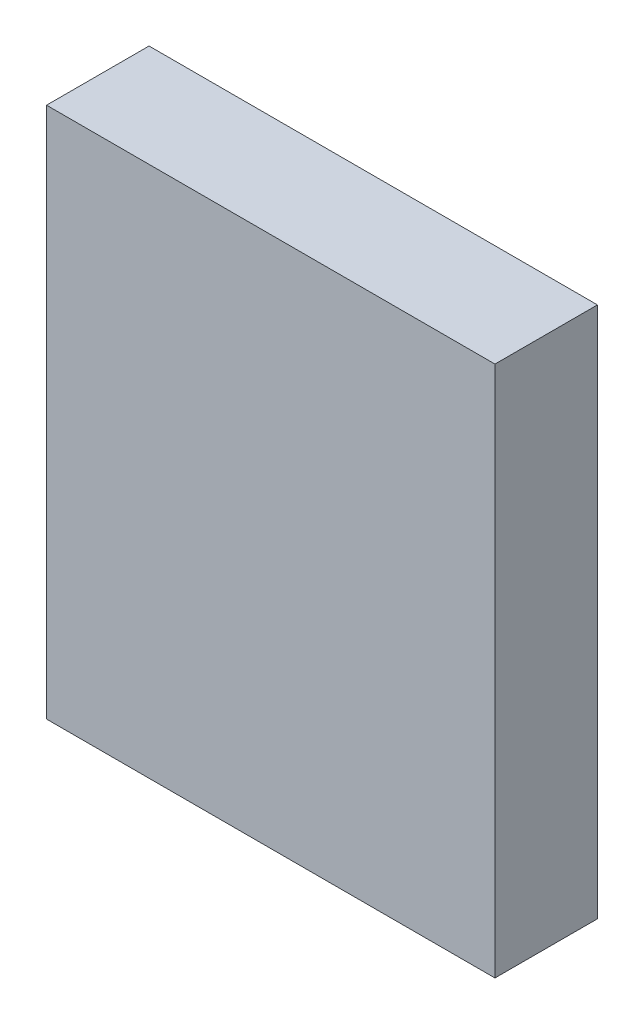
from build123d import *

# Parameters (mm, degrees)
ESQUISSE1_W      = 35
ESQUISSE1_H      = 41.5
EXTRUSION1_DEPTH = 8


with BuildPart() as part:
    # Esquisse1 → Extrusion1 (new body)
    with BuildSketch(Plane.XY):
        with Locations((17.5, 20.75)):
            Rectangle(ESQUISSE1_W, ESQUISSE1_H)
    extrude(amount=EXTRUSION1_DEPTH)


solid = part.part
